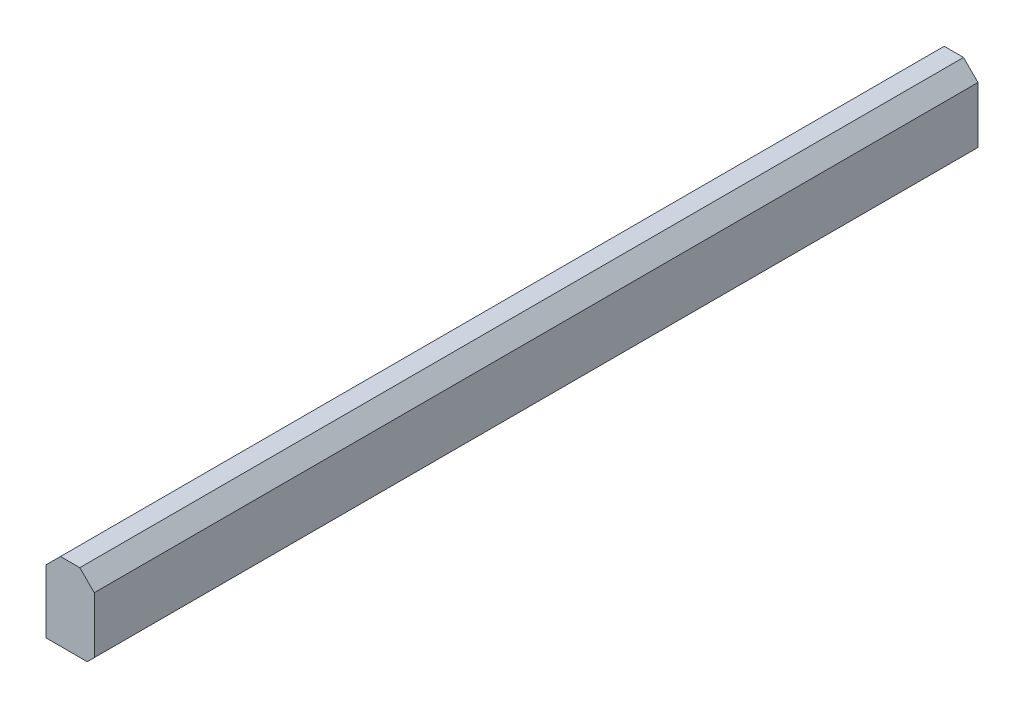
from build123d import *

# Parameters (mm, degrees)
SKETCH2_W           = 188.214
SKETCH2_H           = 116.84
BOSS_EXTRUDE1_DEPTH = 1069.69647766
CHAMFER1_SIZE       = 17
CHAMFER2_SIZE       = 35


with BuildPart() as part:
    # Sketch2 → Boss-Extrude1 (new, symmetric)
    with BuildSketch(Plane(origin=(0, 0, 0), x_dir=(0, 1, 0), z_dir=(0, 0, 1))):
        Rectangle(SKETCH2_W, SKETCH2_H)
    extrude(amount=BOSS_EXTRUDE1_DEPTH, both=True)

    # Chamfer1
    chamfer1_edges = [part.edges().sort_by_distance(p)[0] for p in [
        (58.42, -94.107, 0),
    ]]
    chamfer(chamfer1_edges, length=CHAMFER1_SIZE)

    # Chamfer2
    chamfer2_edges = [part.edges().sort_by_distance(p)[0] for p in [
        (58.42, 94.107, 0),
        (-58.42, 94.107, 0),
    ]]
    chamfer(chamfer2_edges, length=CHAMFER2_SIZE)


solid = part.part
